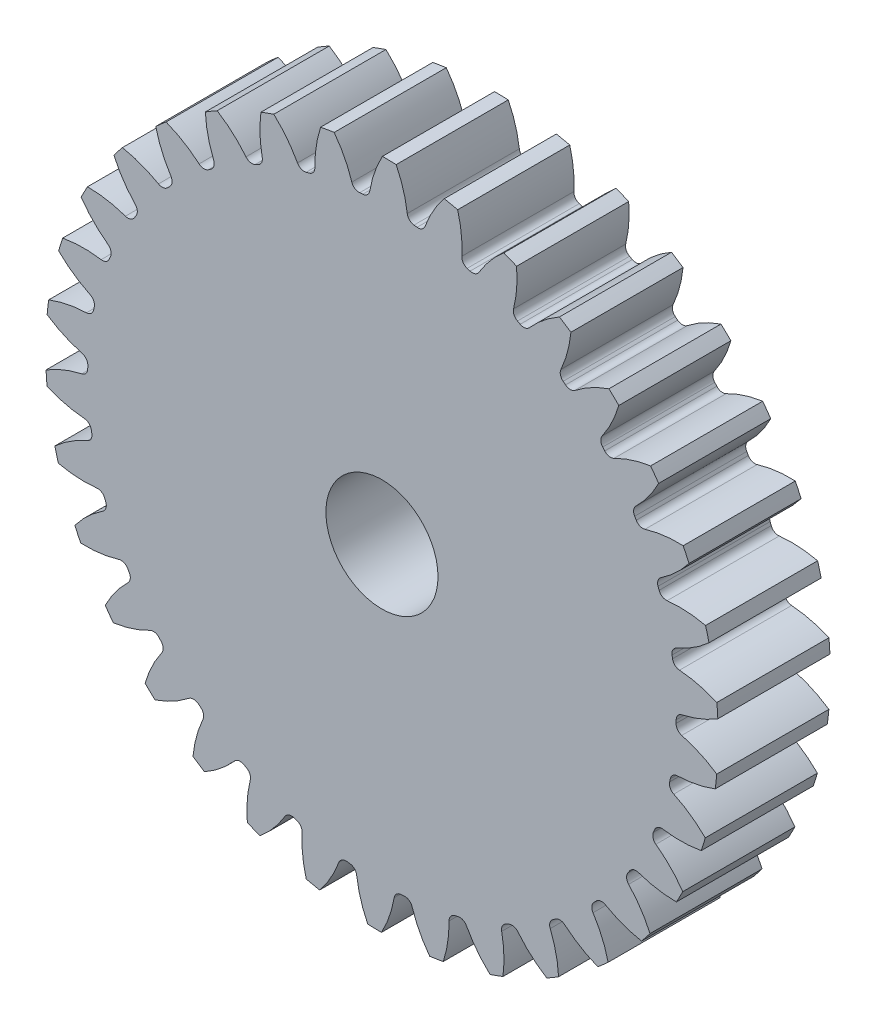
from build123d import *

# Parameters (mm, degrees)
SKETCH3_R         = 304.8
GEARBODY_DEPTH    = 101.6
TOOTHCUT_DEPTH    = 443.864132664
CIRPATTERN1_COUNT = 34
BOREDIA_R         = 50.8
BORE_DEPTH        = 12700


with BuildPart() as part:
    # Sketch3 → gearBody (new body)
    with BuildSketch(Plane.XY):
        Circle(SKETCH3_R)
    extrude(amount=GEARBODY_DEPTH)

    # Sketch2 → toothCut (cut, through all)
    with BuildSketch(Plane.XY):
        with BuildLine():
            ThreePointArc((266.601825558, -7.235786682), (266.636293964, -5.828957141), (266.66333873, -4.421965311))
            ThreePointArc((266.66333873, -4.421965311), (268.22142839, -0.170601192), (272.081355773, 2.196401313))
            ThreePointArc((272.081355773, 2.196401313), (289.01172565, 7.451010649), (304.8, 15.511949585))
            ThreePointArc((304.8, 15.511949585), (305.121562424, -6.670286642), (303.83091524, -28.817278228))
            ThreePointArc((303.83091524, -28.817278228), (288.409997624, -20.074072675), (271.725435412, -14.084604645))
            ThreePointArc((271.725435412, -14.084604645), (267.972636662, -11.551179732), (266.601825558, -7.235786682))
        make_face()
    toothcut = extrude(amount=TOOTHCUT_DEPTH, mode=Mode.SUBTRACT)

    # CirPattern1: toothCut ×34 about axis
    cirpattern1_axis = Axis((0, 0, 0), (0, 0, 1))
    for i in range(1, CIRPATTERN1_COUNT):
        add(toothcut.rotate(cirpattern1_axis, i * 360 / CIRPATTERN1_COUNT), mode=Mode.SUBTRACT)

    # boreDia → bore (cut, symmetric)
    with BuildSketch(Plane.XY):
        Circle(BOREDIA_R)
    extrude(amount=BORE_DEPTH, both=True, mode=Mode.SUBTRACT)


solid = part.part
